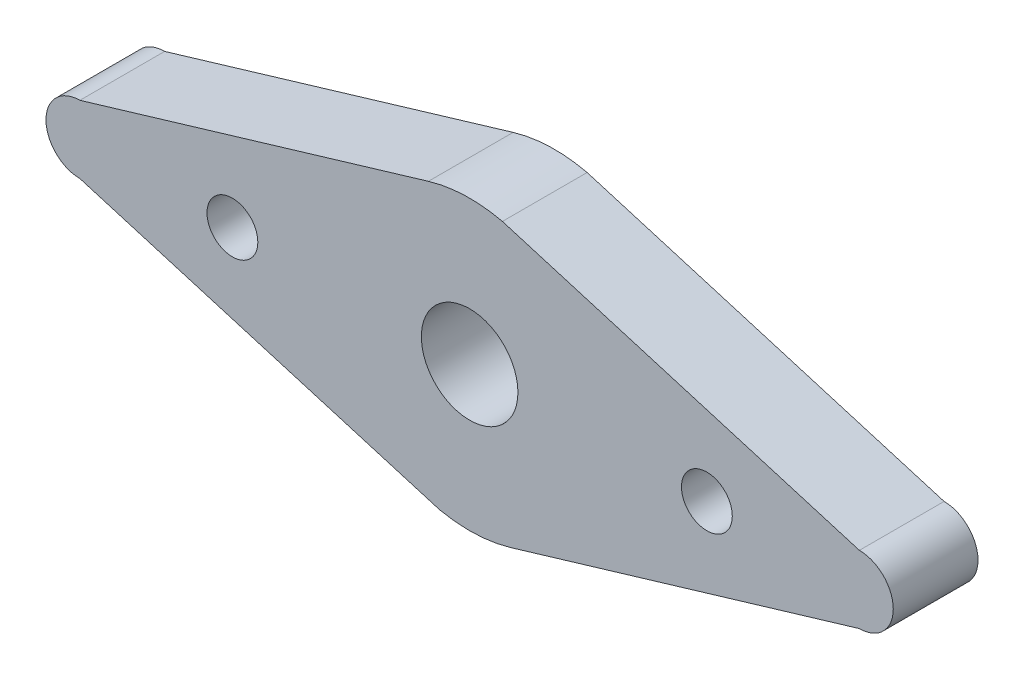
from build123d import *

# Parameters (mm, degrees)
SKETCH1_R           = 1.5
SKETCH1_R_2         = 2.85
BOSS_EXTRUDE1_DEPTH = 5


with BuildPart() as part:
    # Sketch1 → Boss-Extrude1 (new body)
    with BuildSketch(Plane.XY):
        with BuildLine():
            Line((-2.43309837, 8.144325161), (-23.000002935, 2.000009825))
            ThreePointArc((-23.000002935, 2.000009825), (-25.000012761, 0), (-23.000002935, -2.000009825))
            Line((-23.000002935, -2.000009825), (-3.067985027, -7.92700876))
            Line((-3.067985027, -7.92700876), (-1.761868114, -8.315396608))
            ThreePointArc((-1.761868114, -8.315396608), (0.346343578, -8.492940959), (2.43309837, -8.144325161))
            Line((2.43309837, -8.144325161), (23.000002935, -2.000009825))
            ThreePointArc((23.000002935, -2.000009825), (25.000012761, 0), (23.000002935, 2.000009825))
            Line((23.000002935, 2.000009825), (2.91251531, 7.985440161))
            Line((2.91251531, 7.985440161), (1.933242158, 8.277232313))
            ThreePointArc((1.933242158, 8.277232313), (-0.258611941, 8.496064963), (-2.43309837, 8.144325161))
        make_face()
        with Locations((-14.000002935, 0)):
            Circle(SKETCH1_R, mode=Mode.SUBTRACT)
        Circle(SKETCH1_R_2, mode=Mode.SUBTRACT)
        with Locations((14.000002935, 0)):
            Circle(SKETCH1_R, mode=Mode.SUBTRACT)
    extrude(amount=BOSS_EXTRUDE1_DEPTH)


solid = part.part
